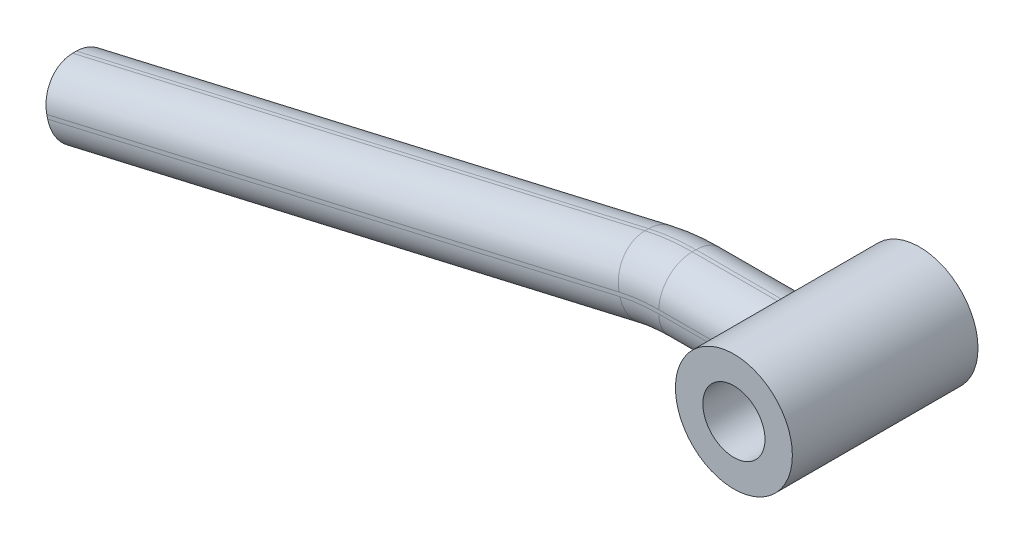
from build123d import *

# Parameters (mm, degrees)
BASE_EXTRUDE_DEPTH       = 6.35
BASE_EXTRUDE_DEPTH_BACK  = 6.35
SKETCH1_R                = 4.0005
BOSS_EXTRUDE1_DEPTH      = 2.413
BOSS_EXTRUDE1_DEPTH_BACK = 2.413
FILLET1_R                = 2.286
SKETCH3_R                = 2.126012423
CUT_EXTRUDE1_DEPTH       = 55.283896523


with BuildPart() as part:
    # Sketch1 → Base-Extrude (new, two sides: drawn at the far end of the back side and taken through both)
    with BuildSketch(Plane.XY.offset(-BASE_EXTRUDE_DEPTH_BACK)):
        Circle(SKETCH1_R)
    extrude(amount=BASE_EXTRUDE_DEPTH + BASE_EXTRUDE_DEPTH_BACK)

    # Sketch2 → Boss-Extrude1 (add, two sides: drawn at the far end of the back side and taken through both)
    with BuildSketch(Plane.XY.offset(-BOSS_EXTRUDE1_DEPTH_BACK)):
        with BuildLine():
            Line((-51.460798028, -7.012998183), (-50.373197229, -11.714848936))
            Line((-50.373197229, -11.714848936), (-11.219305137, -2.658031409))
            ThreePointArc((-11.219305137, -2.658031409), (-10.152984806, -2.474456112), (-9.072724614, -2.413))
            Line((-9.072724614, -2.413), (0, -2.413))
            Line((0, -2.413), (0, 2.413))
            Line((0, 2.413), (-9.072724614, 2.413))
            ThreePointArc((-9.072724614, 2.413), (-10.700316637, 2.320406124), (-12.306905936, 2.043819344))
            Line((-12.306905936, 2.043819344), (-51.460798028, -7.012998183))
        make_face()
    extrude(amount=BOSS_EXTRUDE1_DEPTH + BOSS_EXTRUDE1_DEPTH_BACK)

    # Fillet1
    fillet1_edges = [part.edges().sort_by_distance(p)[0] for p in [
        (-10.700316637, 2.320406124, 2.413),
        (-6.131780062, 2.413, 2.413),
        (-6.131780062, -2.413, 2.413),
        (-10.152984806, -2.474456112, 2.413),
        (-30.796251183, -7.186440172, 2.413),
        (-31.883851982, -2.484589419, 2.413),
        (-31.883851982, -2.484589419, -2.413),
        (-30.796251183, -7.186440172, -2.413),
        (-10.152984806, -2.474456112, -2.413),
        (-10.700316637, 2.320406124, -2.413),
        (-6.131780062, -2.413, -2.413),
        (-6.131780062, 2.413, -2.413),
    ]]
    fillet(fillet1_edges, radius=FILLET1_R)

    # Sketch3 → Cut-Extrude1 (cut, through all)
    with BuildSketch(Plane.XY.offset(6.35)):
        Circle(SKETCH3_R)
    extrude(amount=-CUT_EXTRUDE1_DEPTH, mode=Mode.SUBTRACT)


solid = part.part
